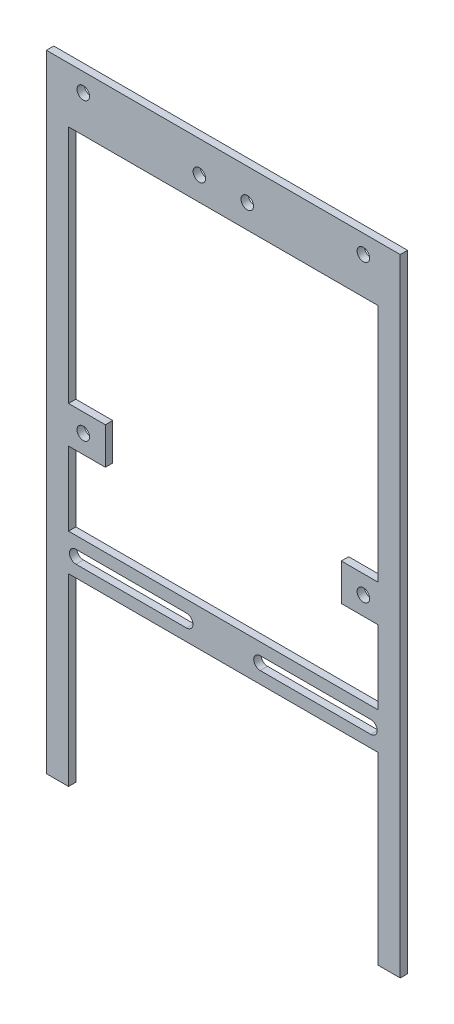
from build123d import *

# Parameters (mm, degrees)
SKETCH_1_W              = 94
SKETCH_1_H              = 170
EXTRUDE_1_DEPTH         = 2
HOLE_WIZARD_3_4_3_4_1_D = 3.4
HOLE_WIZARD_3_4_3_4_2_D = 3.4
CUT_EXTRUDE_1_REACH     = 99.149
SKETCH_8_W              = 2
SKETCH_8_H              = 170
EXTRUDE_2_DEPTH         = 1
SKETCH_9_W              = 2
SKETCH_9_H              = 170
EXTRUDE_3_DEPTH         = 1
CUT_EXTRUDE_2_REACH     = 99.637


with BuildPart() as part:
    # Sketch 1 → Extrude 1 (new body)
    with BuildSketch(Plane.XY):
        Rectangle(SKETCH_1_W, SKETCH_1_H)
    extrude(amount=EXTRUDE_1_DEPTH)

    # Hole Wizard 3.4 _3.4_ _1 (through all)
    with Locations(Plane.XY.offset(2)):
        with Locations((-6.5, 76.44363865), (6.5, 76.44363865)):
            Hole(HOLE_WIZARD_3_4_3_4_1_D / 2)

    # Hole Wizard 3.4 _3.4_ _2 (through all)
    with Locations(Plane.XY.offset(2)):
        with Locations((-38, 80), (38, 80), (-38, 0), (38, 0)):
            Hole(HOLE_WIZARD_3_4_3_4_2_D / 2)

    # Sketch 6 → Cut-Extrude 1 (cut, up to next)
    with BuildSketch(Plane.XY.offset(2), mode=Mode.PRIVATE) as cut_extrude_1_sk1:
        Polygon((32, -5), (32, 5), (42, 5), (42, 70), (32, 70), (-32, 70), (-42, 70), (-42, 5), (-32, 5), (-32, -5), (-42, -5), (-42, -25), (42, -25), (42, -5), align=None)
    cut_extrude_1_tool1 = extrude(cut_extrude_1_sk1.sketch, amount=-CUT_EXTRUDE_1_REACH, mode=Mode.PRIVATE) & part.part
    # Sketch 6 → Cut-Extrude 1 (cut, up to next)
    with BuildSketch(Plane.XY.offset(2), mode=Mode.PRIVATE) as cut_extrude_1_sk2:
        Polygon((-42, -85), (-32, -85), (32, -85), (42, -85), (42, -35), (-42, -35), (-42, -72.18140491), (-42, -73.286487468), align=None)
    cut_extrude_1_tool2 = extrude(cut_extrude_1_sk2.sketch, amount=-CUT_EXTRUDE_1_REACH, mode=Mode.PRIVATE) & part.part
    add(cut_extrude_1_tool1.solids().sort_by_distance((0, 23.078406, 2))[0], mode=Mode.SUBTRACT)
    add(cut_extrude_1_tool2.solids().sort_by_distance((0, -60, 2))[0], mode=Mode.SUBTRACT)

    # Sketch 8 → Extrude 2 (add)
    with BuildSketch(Plane(origin=(47, 0, 0), x_dir=(0, 0, -1), z_dir=(1, 0, 0))):
        with Locations((-1, 0)):
            Rectangle(SKETCH_8_W, SKETCH_8_H)
    extrude(amount=EXTRUDE_2_DEPTH)

    # Sketch 9 → Extrude 3 (add)
    with BuildSketch(Plane.ZY.offset(47)):
        with Locations((1, 0)):
            Rectangle(SKETCH_9_W, SKETCH_9_H)
    extrude(amount=EXTRUDE_3_DEPTH)

    # Sketch 10 → Cut-Extrude 2 (cut, up to next)
    with BuildSketch(Plane.XY.offset(2), mode=Mode.PRIVATE) as cut_extrude_2_sk1:
        with BuildLine():
            Line((-40, -28.25), (-10, -28.25))
            ThreePointArc((-10, -28.25), (-8.25, -30), (-10, -31.75))
            Line((-10, -31.75), (-40, -31.75))
            ThreePointArc((-40, -31.75), (-41.75, -30), (-40, -28.25))
        make_face()
    cut_extrude_2_tool1 = extrude(cut_extrude_2_sk1.sketch, amount=-CUT_EXTRUDE_2_REACH, mode=Mode.PRIVATE) & part.part
    # Sketch 10 → Cut-Extrude 2 (cut, up to next)
    with BuildSketch(Plane.XY.offset(2), mode=Mode.PRIVATE) as cut_extrude_2_sk2:
        with BuildLine():
            Line((10, -28.25), (40, -28.25))
            ThreePointArc((40, -28.25), (41.75, -30), (40, -31.75))
            Line((40, -31.75), (10, -31.75))
            ThreePointArc((10, -31.75), (8.25, -30), (10, -28.25))
        make_face()
    cut_extrude_2_tool2 = extrude(cut_extrude_2_sk2.sketch, amount=-CUT_EXTRUDE_2_REACH, mode=Mode.PRIVATE) & part.part
    add(cut_extrude_2_tool1.solids().sort_by_distance((-25, -30, 2))[0], mode=Mode.SUBTRACT)
    add(cut_extrude_2_tool2.solids().sort_by_distance((25, -30, 2))[0], mode=Mode.SUBTRACT)


solid = part.part
